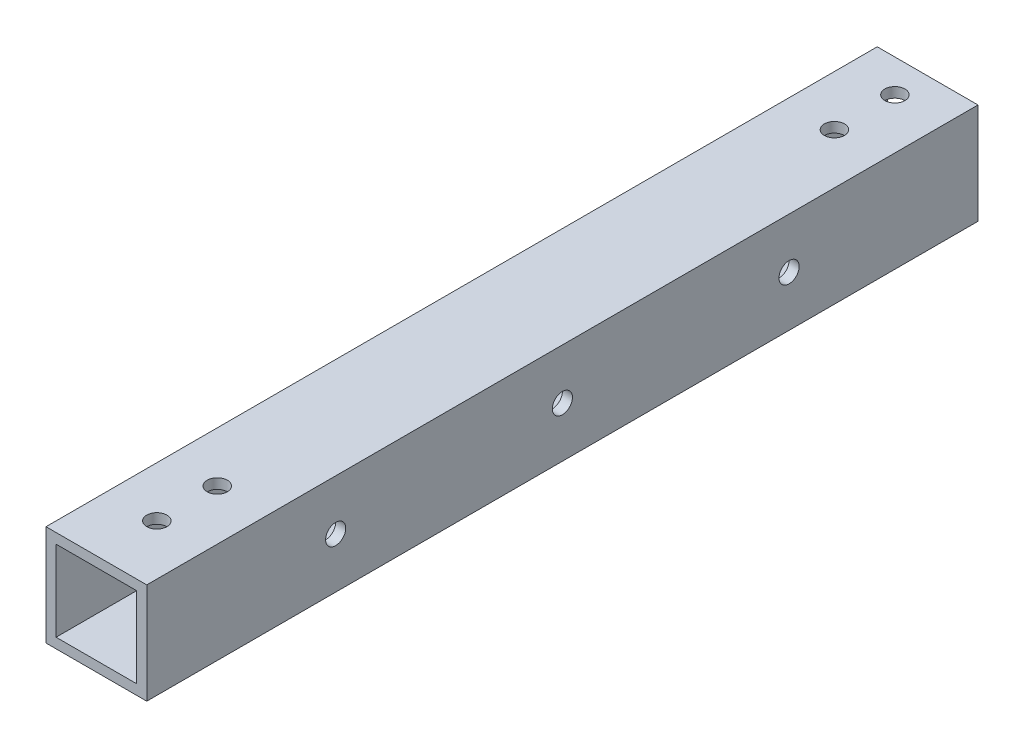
from build123d import *

# Parameters (mm, degrees)
SKETCH_1_W            = 20
SKETCH_1_H            = 20
SKETCH_1_W_2          = 16
SKETCH_1_H_2          = 16
EXTRUDE_1_DEPTH       = 165
HOLE_WIZARD_4_0_4_2_D = 4
HOLE_WIZARD_4_0_4_3_D = 4


with BuildPart() as part:
    # Sketch 1 → Extrude 1 (new body)
    with BuildSketch(Plane.XY):
        Rectangle(SKETCH_1_W, SKETCH_1_H)
        Rectangle(SKETCH_1_W_2, SKETCH_1_H_2, mode=Mode.SUBTRACT)
    extrude(amount=EXTRUDE_1_DEPTH)

    # Hole Wizard 4.0 _4_ _2 (through all)
    with Locations(Plane(origin=(0, 10, 0), x_dir=(1, 0, 0), z_dir=(0, 1, 0))):
        with Locations((0, -153), (0, -141), (0, -18.5), (0, -6.5)):
            Hole(HOLE_WIZARD_4_0_4_2_D / 2)

    # Hole Wizard 4.0 _4_ _3 (through all)
    with Locations(Plane.ZY.offset(10)):
        with Locations((37.5, 0), (82.5, 0), (127.5, 0)):
            Hole(HOLE_WIZARD_4_0_4_3_D / 2)


solid = part.part
